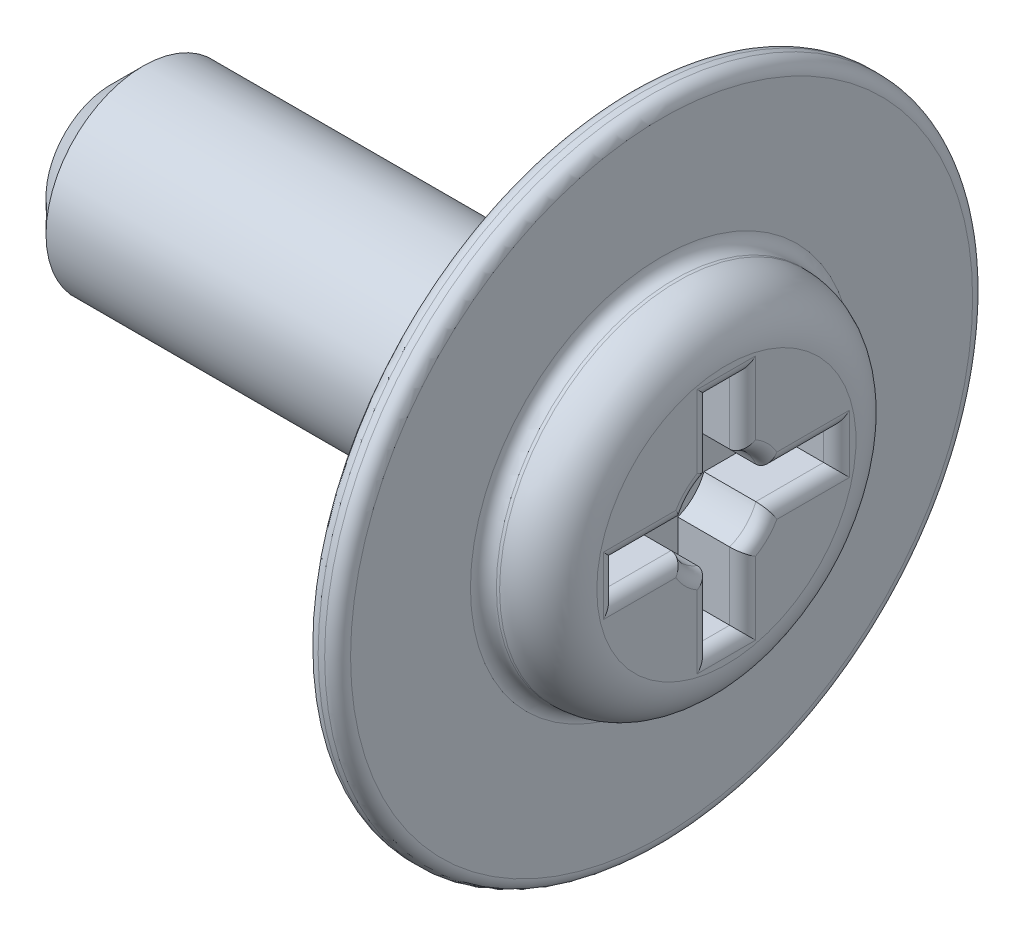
ISO-10303-21;
HEADER;
FILE_DESCRIPTION(('STEP AP214'),'2;1');
FILE_NAME('part.step','',(''),(''),'','','');
FILE_SCHEMA(('AUTOMOTIVE_DESIGN { 1 0 10303 214 1 1 1 1 }'));
ENDSEC;
DATA;
#1=APPLICATION_CONTEXT('core data for automotive mechanical design processes');
#2=APPLICATION_PROTOCOL_DEFINITION('international standard','automotive_design',2000,#1);
#3=PRODUCT_CONTEXT('',#1,'mechanical');
#4=PRODUCT('Part','Part','',(#3));
#5=PRODUCT_RELATED_PRODUCT_CATEGORY('part','',(#4));
#6=PRODUCT_DEFINITION_FORMATION('','',#4);
#7=PRODUCT_DEFINITION_CONTEXT('part definition',#1,'design');
#8=PRODUCT_DEFINITION('design','',#6,#7);
#9=PRODUCT_DEFINITION_SHAPE('','',#8);
#10=(LENGTH_UNIT() NAMED_UNIT(*) SI_UNIT(.MILLI.,.METRE.));
#11=(NAMED_UNIT(*) PLANE_ANGLE_UNIT() SI_UNIT($,.RADIAN.));
#12=(NAMED_UNIT(*) SI_UNIT($,.STERADIAN.) SOLID_ANGLE_UNIT());
#13=UNCERTAINTY_MEASURE_WITH_UNIT(LENGTH_MEASURE(1.E-05),#10,'distance_accuracy_value','');
#14=(GEOMETRIC_REPRESENTATION_CONTEXT(3) GLOBAL_UNCERTAINTY_ASSIGNED_CONTEXT((#13)) GLOBAL_UNIT_ASSIGNED_CONTEXT((#10,
#11,#12)) REPRESENTATION_CONTEXT('',''));
#15=CARTESIAN_POINT('',(0.,0.,0.));
#16=DIRECTION('',(0.,0.,1.));
#17=DIRECTION('',(1.,0.,0.));
#18=AXIS2_PLACEMENT_3D('',#15,#16,#17);
#19=CARTESIAN_POINT('',(0.,0.,0.));
#20=DIRECTION('',(1.,0.,0.));
#21=DIRECTION('',(0.,0.,-1.));
#22=AXIS2_PLACEMENT_3D('',#19,#20,#21);
#23=PLANE('',#22);
#24=CARTESIAN_POINT('',(0.,0.,0.));
#25=DIRECTION('',(1.,0.,0.));
#26=DIRECTION('',(0.,0.,-1.));
#27=AXIS2_PLACEMENT_3D('',#24,#25,#26);
#28=CIRCLE('',#27,1.);
#29=CARTESIAN_POINT('',(0.,0.,-1.));
#30=VERTEX_POINT('',#29);
#31=EDGE_CURVE('E262',#30,#30,#28,.F.);
#32=ORIENTED_EDGE('',*,*,#31,.T.);
#33=EDGE_LOOP('',(#32));
#34=FACE_BOUND('',#33,.T.);
#35=ADVANCED_FACE('F31',(#34),#23,.F.);
#36=CARTESIAN_POINT('',(0.,0.,0.));
#37=DIRECTION('',(-1.,0.,0.));
#38=DIRECTION('',(0.,0.,1.));
#39=AXIS2_PLACEMENT_3D('',#36,#37,#38);
#40=CYLINDRICAL_SURFACE('',#39,1.5);
#41=CARTESIAN_POINT('',(0.500000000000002,0.,0.));
#42=DIRECTION('',(1.,0.,0.));
#43=DIRECTION('',(0.,0.,-1.));
#44=AXIS2_PLACEMENT_3D('',#41,#42,#43);
#45=CIRCLE('',#44,1.5);
#46=CARTESIAN_POINT('',(0.500000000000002,0.,-1.5));
#47=VERTEX_POINT('',#46);
#48=EDGE_CURVE('E265',#47,#47,#45,.T.);
#49=ORIENTED_EDGE('',*,*,#48,.T.);
#50=EDGE_LOOP('',(#49));
#51=FACE_BOUND('',#50,.T.);
#52=CARTESIAN_POINT('',(8.,0.,0.));
#53=DIRECTION('',(-1.,0.,0.));
#54=DIRECTION('',(0.,0.,1.));
#55=AXIS2_PLACEMENT_3D('',#52,#53,#54);
#56=CIRCLE('',#55,1.5);
#57=CARTESIAN_POINT('',(8.,0.,1.5));
#58=VERTEX_POINT('',#57);
#59=EDGE_CURVE('E256',#58,#58,#56,.T.);
#60=ORIENTED_EDGE('',*,*,#59,.T.);
#61=EDGE_LOOP('',(#60));
#62=FACE_BOUND('',#61,.T.);
#63=ADVANCED_FACE('F365',(#51,#62),#40,.T.);
#64=CARTESIAN_POINT('',(8.,1.5,0.));
#65=DIRECTION('',(1.,0.,0.));
#66=DIRECTION('',(0.,0.,-1.));
#67=AXIS2_PLACEMENT_3D('',#64,#65,#66);
#68=PLANE('',#67);
#69=CARTESIAN_POINT('',(8.,0.,0.));
#70=DIRECTION('',(1.,0.,0.));
#71=DIRECTION('',(0.,0.,-1.));
#72=AXIS2_PLACEMENT_3D('',#69,#70,#71);
#73=CIRCLE('',#72,4.8);
#74=CARTESIAN_POINT('',(8.,0.,-4.8));
#75=VERTEX_POINT('',#74);
#76=EDGE_CURVE('E38',#75,#75,#73,.F.);
#77=ORIENTED_EDGE('',*,*,#76,.T.);
#78=EDGE_LOOP('',(#77));
#79=FACE_BOUND('',#78,.T.);
#80=ORIENTED_EDGE('',*,*,#59,.F.);
#81=EDGE_LOOP('',(#80));
#82=FACE_BOUND('',#81,.T.);
#83=ADVANCED_FACE('F345',(#79,#82),#68,.F.);
#84=CARTESIAN_POINT('',(0.,0.,0.));
#85=DIRECTION('',(-1.,0.,0.));
#86=DIRECTION('',(0.,0.,1.));
#87=AXIS2_PLACEMENT_3D('',#84,#85,#86);
#88=CYLINDRICAL_SURFACE('',#87,5.);
#89=CARTESIAN_POINT('',(8.3,0.,0.));
#90=DIRECTION('',(-1.,0.,0.));
#91=DIRECTION('',(0.,0.,1.));
#92=AXIS2_PLACEMENT_3D('',#89,#90,#91);
#93=CIRCLE('',#92,5.);
#94=CARTESIAN_POINT('',(8.3,0.,5.));
#95=VERTEX_POINT('',#94);
#96=EDGE_CURVE('E334',#95,#95,#93,.T.);
#97=ORIENTED_EDGE('',*,*,#96,.T.);
#98=EDGE_LOOP('',(#97));
#99=FACE_BOUND('',#98,.T.);
#100=CARTESIAN_POINT('',(8.2,0.,0.));
#101=DIRECTION('',(1.,0.,0.));
#102=DIRECTION('',(0.,0.,-1.));
#103=AXIS2_PLACEMENT_3D('',#100,#101,#102);
#104=CIRCLE('',#103,5.);
#105=CARTESIAN_POINT('',(8.2,0.,-5.));
#106=VERTEX_POINT('',#105);
#107=EDGE_CURVE('E331',#106,#106,#104,.T.);
#108=ORIENTED_EDGE('',*,*,#107,.T.);
#109=EDGE_LOOP('',(#108));
#110=FACE_BOUND('',#109,.T.);
#111=ADVANCED_FACE('F451',(#99,#110),#88,.T.);
#112=CARTESIAN_POINT('',(8.5,5.,0.));
#113=DIRECTION('',(-1.,0.,0.));
#114=DIRECTION('',(0.,0.,1.));
#115=AXIS2_PLACEMENT_3D('',#112,#113,#114);
#116=PLANE('',#115);
#117=CARTESIAN_POINT('',(8.5,0.,0.));
#118=DIRECTION('',(-1.,0.,0.));
#119=DIRECTION('',(0.,0.,1.));
#120=AXIS2_PLACEMENT_3D('',#117,#118,#119);
#121=CIRCLE('',#120,4.8);
#122=CARTESIAN_POINT('',(8.5,0.,4.8));
#123=VERTEX_POINT('',#122);
#124=EDGE_CURVE('E340',#123,#123,#121,.F.);
#125=ORIENTED_EDGE('',*,*,#124,.T.);
#126=EDGE_LOOP('',(#125));
#127=FACE_BOUND('',#126,.T.);
#128=CARTESIAN_POINT('',(8.5,0.,0.));
#129=DIRECTION('',(-1.,0.,0.));
#130=DIRECTION('',(0.,0.,1.));
#131=AXIS2_PLACEMENT_3D('',#128,#129,#130);
#132=CIRCLE('',#131,2.95);
#133=CARTESIAN_POINT('',(8.5,0.,2.95));
#134=VERTEX_POINT('',#133);
#135=EDGE_CURVE('E337',#134,#134,#132,.T.);
#136=ORIENTED_EDGE('',*,*,#135,.T.);
#137=EDGE_LOOP('',(#136));
#138=FACE_BOUND('',#137,.T.);
#139=ADVANCED_FACE('F447',(#127,#138),#116,.F.);
#140=CARTESIAN_POINT('',(0.,0.,0.));
#141=DIRECTION('',(-1.,0.,0.));
#142=DIRECTION('',(0.,0.,1.));
#143=AXIS2_PLACEMENT_3D('',#140,#141,#142);
#144=CYLINDRICAL_SURFACE('',#143,2.75);
#145=CARTESIAN_POINT('',(8.7,0.,0.));
#146=DIRECTION('',(-1.,0.,0.));
#147=DIRECTION('',(0.,0.,1.));
#148=AXIS2_PLACEMENT_3D('',#145,#146,#147);
#149=CIRCLE('',#148,2.75);
#150=CARTESIAN_POINT('',(8.7,0.,2.75));
#151=VERTEX_POINT('',#150);
#152=EDGE_CURVE('E11',#151,#151,#149,.F.);
#153=ORIENTED_EDGE('',*,*,#152,.T.);
#154=EDGE_LOOP('',(#153));
#155=FACE_BOUND('',#154,.T.);
#156=CARTESIAN_POINT('',(8.75,0.,0.));
#157=DIRECTION('',(-1.,0.,0.));
#158=DIRECTION('',(0.,0.,1.));
#159=AXIS2_PLACEMENT_3D('',#156,#157,#158);
#160=CIRCLE('',#159,2.75);
#161=CARTESIAN_POINT('',(8.75,0.,2.75));
#162=VERTEX_POINT('',#161);
#163=EDGE_CURVE('E253',#162,#162,#160,.T.);
#164=ORIENTED_EDGE('',*,*,#163,.T.);
#165=EDGE_LOOP('',(#164));
#166=FACE_BOUND('',#165,.T.);
#167=ADVANCED_FACE('F443',(#155,#166),#144,.T.);
#168=CARTESIAN_POINT('',(8.75,0.,0.));
#169=DIRECTION('',(-1.,0.,0.));
#170=DIRECTION('',(0.,0.,1.));
#171=AXIS2_PLACEMENT_3D('',#168,#169,#170);
#172=TOROIDAL_SURFACE('',#171,2.,0.750000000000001);
#173=ORIENTED_EDGE('',*,*,#163,.F.);
#174=EDGE_LOOP('',(#173));
#175=FACE_BOUND('',#174,.T.);
#176=CARTESIAN_POINT('',(9.5,0.,0.));
#177=DIRECTION('',(-1.,0.,0.));
#178=DIRECTION('',(0.,0.,1.));
#179=AXIS2_PLACEMENT_3D('',#176,#177,#178);
#180=CIRCLE('',#179,2.);
#181=CARTESIAN_POINT('',(9.5,0.,2.));
#182=VERTEX_POINT('',#181);
#183=EDGE_CURVE('E248',#182,#182,#180,.T.);
#184=ORIENTED_EDGE('',*,*,#183,.T.);
#185=EDGE_LOOP('',(#184));
#186=FACE_BOUND('',#185,.T.);
#187=ADVANCED_FACE('F439',(#175,#186),#172,.T.);
#188=CARTESIAN_POINT('',(9.5,2.,0.));
#189=DIRECTION('',(-1.,0.,0.));
#190=DIRECTION('',(0.,0.,1.));
#191=AXIS2_PLACEMENT_3D('',#188,#189,#190);
#192=PLANE('',#191);
#193=DIRECTION('',(0.,0.,-1.));
#194=VECTOR('',#193,1.);
#195=CARTESIAN_POINT('',(9.5,-0.45,0.));
#196=LINE('',#195,#194);
#197=CARTESIAN_POINT('',(9.5,-0.450000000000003,0.779159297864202));
#198=VERTEX_POINT('',#197);
#199=CARTESIAN_POINT('',(9.5,-0.450000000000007,1.9));
#200=VERTEX_POINT('',#199);
#201=EDGE_CURVE('E299',#198,#200,#196,.F.);
#202=ORIENTED_EDGE('',*,*,#201,.T.);
#203=DIRECTION('',(0.,-1.,0.));
#204=VECTOR('',#203,1.);
#205=CARTESIAN_POINT('',(9.5,1.99999999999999,1.90000000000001));
#206=LINE('',#205,#204);
#207=CARTESIAN_POINT('',(9.5,0.449999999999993,1.9));
#208=VERTEX_POINT('',#207);
#209=EDGE_CURVE('E301',#200,#208,#206,.F.);
#210=ORIENTED_EDGE('',*,*,#209,.T.);
#211=DIRECTION('',(0.,0.,1.));
#212=VECTOR('',#211,1.);
#213=CARTESIAN_POINT('',(9.5,0.45,0.));
#214=LINE('',#213,#212);
#215=CARTESIAN_POINT('',(9.5,0.449999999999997,0.779159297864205));
#216=VERTEX_POINT('',#215);
#217=EDGE_CURVE('E271',#208,#216,#214,.F.);
#218=ORIENTED_EDGE('',*,*,#217,.T.);
#219=CARTESIAN_POINT('',(9.5,0.,0.));
#220=DIRECTION('',(-1.,0.,0.));
#221=DIRECTION('',(0.,0.,1.));
#222=AXIS2_PLACEMENT_3D('',#219,#220,#221);
#223=CIRCLE('',#222,0.89977175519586);
#224=CARTESIAN_POINT('',(9.5,0.779159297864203,0.45));
#225=VERTEX_POINT('',#224);
#226=EDGE_CURVE('E273',#216,#225,#223,.T.);
#227=ORIENTED_EDGE('',*,*,#226,.T.);
#228=DIRECTION('',(0.,-1.,0.));
#229=VECTOR('',#228,1.);
#230=CARTESIAN_POINT('',(9.5,2.,0.45));
#231=LINE('',#230,#229);
#232=CARTESIAN_POINT('',(9.5,1.9,0.45));
#233=VERTEX_POINT('',#232);
#234=EDGE_CURVE('E275',#225,#233,#231,.F.);
#235=ORIENTED_EDGE('',*,*,#234,.T.);
#236=DIRECTION('',(0.,0.,1.));
#237=VECTOR('',#236,1.);
#238=CARTESIAN_POINT('',(9.5,1.9,0.));
#239=LINE('',#238,#237);
#240=CARTESIAN_POINT('',(9.5,1.9,-0.45));
#241=VERTEX_POINT('',#240);
#242=EDGE_CURVE('E277',#233,#241,#239,.F.);
#243=ORIENTED_EDGE('',*,*,#242,.T.);
#244=DIRECTION('',(0.,1.,0.));
#245=VECTOR('',#244,1.);
#246=CARTESIAN_POINT('',(9.5,2.,-0.45));
#247=LINE('',#246,#245);
#248=CARTESIAN_POINT('',(9.5,0.779159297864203,-0.45));
#249=VERTEX_POINT('',#248);
#250=EDGE_CURVE('E279',#241,#249,#247,.F.);
#251=ORIENTED_EDGE('',*,*,#250,.T.);
#252=CARTESIAN_POINT('',(9.5,0.,0.));
#253=DIRECTION('',(-1.,0.,0.));
#254=DIRECTION('',(0.,0.,1.));
#255=AXIS2_PLACEMENT_3D('',#252,#253,#254);
#256=CIRCLE('',#255,0.89977175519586);
#257=CARTESIAN_POINT('',(9.5,0.450000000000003,-0.779159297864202));
#258=VERTEX_POINT('',#257);
#259=EDGE_CURVE('E281',#249,#258,#256,.T.);
#260=ORIENTED_EDGE('',*,*,#259,.T.);
#261=DIRECTION('',(0.,0.,1.));
#262=VECTOR('',#261,1.);
#263=CARTESIAN_POINT('',(9.5,0.45,0.));
#264=LINE('',#263,#262);
#265=CARTESIAN_POINT('',(9.5,0.450000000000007,-1.9));
#266=VERTEX_POINT('',#265);
#267=EDGE_CURVE('E283',#258,#266,#264,.F.);
#268=ORIENTED_EDGE('',*,*,#267,.T.);
#269=DIRECTION('',(0.,1.,0.));
#270=VECTOR('',#269,1.);
#271=CARTESIAN_POINT('',(9.5,2.00000000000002,-1.89999999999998));
#272=LINE('',#271,#270);
#273=CARTESIAN_POINT('',(9.5,-0.44999999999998,-1.9));
#274=VERTEX_POINT('',#273);
#275=EDGE_CURVE('E285',#266,#274,#272,.F.);
#276=ORIENTED_EDGE('',*,*,#275,.T.);
#277=DIRECTION('',(0.,0.,-1.));
#278=VECTOR('',#277,1.);
#279=CARTESIAN_POINT('',(9.5,-0.45,0.));
#280=LINE('',#279,#278);
#281=CARTESIAN_POINT('',(9.5,-0.449999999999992,-0.779159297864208));
#282=VERTEX_POINT('',#281);
#283=EDGE_CURVE('E287',#274,#282,#280,.F.);
#284=ORIENTED_EDGE('',*,*,#283,.T.);
#285=CARTESIAN_POINT('',(9.5,0.,0.));
#286=DIRECTION('',(-1.,0.,0.));
#287=DIRECTION('',(0.,0.,1.));
#288=AXIS2_PLACEMENT_3D('',#285,#286,#287);
#289=CIRCLE('',#288,0.89977175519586);
#290=CARTESIAN_POINT('',(9.5,-0.7791592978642,-0.450000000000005));
#291=VERTEX_POINT('',#290);
#292=EDGE_CURVE('E289',#282,#291,#289,.T.);
#293=ORIENTED_EDGE('',*,*,#292,.T.);
#294=DIRECTION('',(0.,1.,0.));
#295=VECTOR('',#294,1.);
#296=CARTESIAN_POINT('',(9.5,2.,-0.449999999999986));
#297=LINE('',#296,#295);
#298=CARTESIAN_POINT('',(9.5,-1.9,-0.450000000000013));
#299=VERTEX_POINT('',#298);
#300=EDGE_CURVE('E291',#291,#299,#297,.F.);
#301=ORIENTED_EDGE('',*,*,#300,.T.);
#302=DIRECTION('',(0.,0.,-1.));
#303=VECTOR('',#302,1.);
#304=CARTESIAN_POINT('',(9.5,-1.9,0.));
#305=LINE('',#304,#303);
#306=CARTESIAN_POINT('',(9.5,-1.9,0.449999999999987));
#307=VERTEX_POINT('',#306);
#308=EDGE_CURVE('E293',#299,#307,#305,.F.);
#309=ORIENTED_EDGE('',*,*,#308,.T.);
#310=DIRECTION('',(0.,-1.,0.));
#311=VECTOR('',#310,1.);
#312=CARTESIAN_POINT('',(9.5,2.,0.450000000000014));
#313=LINE('',#312,#311);
#314=CARTESIAN_POINT('',(9.5,-0.779159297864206,0.449999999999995));
#315=VERTEX_POINT('',#314);
#316=EDGE_CURVE('E295',#307,#315,#313,.F.);
#317=ORIENTED_EDGE('',*,*,#316,.T.);
#318=CARTESIAN_POINT('',(9.5,0.,0.));
#319=DIRECTION('',(-1.,0.,0.));
#320=DIRECTION('',(0.,0.,1.));
#321=AXIS2_PLACEMENT_3D('',#318,#319,#320);
#322=CIRCLE('',#321,0.89977175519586);
#323=EDGE_CURVE('E297',#315,#198,#322,.T.);
#324=ORIENTED_EDGE('',*,*,#323,.T.);
#325=EDGE_LOOP('',(#202,#210,#218,#227,#235,#243,#251,#260,#268,#276,#284,#293,#301,#309,#317,#324));
#326=FACE_BOUND('',#325,.T.);
#327=ORIENTED_EDGE('',*,*,#183,.F.);
#328=EDGE_LOOP('',(#327));
#329=FACE_BOUND('',#328,.T.);
#330=ADVANCED_FACE('F436',(#326,#329),#192,.F.);
#331=CARTESIAN_POINT('',(8.5,0.,0.25));
#332=DIRECTION('',(0.,0.,1.));
#333=DIRECTION('',(1.,0.,0.));
#334=AXIS2_PLACEMENT_3D('',#331,#332,#333);
#335=PLANE('',#334);
#336=DIRECTION('',(1.,0.,0.));
#337=VECTOR('',#336,1.);
#338=CARTESIAN_POINT('',(8.5,1.7,0.25));
#339=LINE('',#338,#337);
#340=CARTESIAN_POINT('',(8.5,1.7,0.25));
#341=VERTEX_POINT('',#340);
#342=CARTESIAN_POINT('',(9.3,1.7,0.25));
#343=VERTEX_POINT('',#342);
#344=EDGE_CURVE('E246',#341,#343,#339,.T.);
#345=ORIENTED_EDGE('',*,*,#344,.T.);
#346=DIRECTION('',(0.,-1.,0.));
#347=VECTOR('',#346,1.);
#348=CARTESIAN_POINT('',(9.3,0.,0.25));
#349=LINE('',#348,#347);
#350=CARTESIAN_POINT('',(9.3,0.653590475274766,0.25));
#351=VERTEX_POINT('',#350);
#352=EDGE_CURVE('E53',#343,#351,#349,.T.);
#353=ORIENTED_EDGE('',*,*,#352,.T.);
#354=DIRECTION('',(1.,0.,0.));
#355=VECTOR('',#354,1.);
#356=CARTESIAN_POINT('',(6.52074658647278,0.653590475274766,0.25));
#357=LINE('',#356,#355);
#358=CARTESIAN_POINT('',(8.5,0.653590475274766,0.25));
#359=VERTEX_POINT('',#358);
#360=EDGE_CURVE('E805',#351,#359,#357,.F.);
#361=ORIENTED_EDGE('',*,*,#360,.T.);
#362=DIRECTION('',(0.,-1.,0.));
#363=VECTOR('',#362,1.);
#364=CARTESIAN_POINT('',(8.5,0.,0.25));
#365=LINE('',#364,#363);
#366=EDGE_CURVE('E235',#341,#359,#365,.T.);
#367=ORIENTED_EDGE('',*,*,#366,.F.);
#368=EDGE_LOOP('',(#345,#353,#361,#367));
#369=FACE_BOUND('',#368,.T.);
#370=ADVANCED_FACE('F429',(#369),#335,.F.);
#371=CARTESIAN_POINT('',(8.5,1.7,0.25));
#372=DIRECTION('',(0.,1.,0.));
#373=DIRECTION('',(0.,0.,1.));
#374=AXIS2_PLACEMENT_3D('',#371,#372,#373);
#375=PLANE('',#374);
#376=DIRECTION('',(1.,0.,0.));
#377=VECTOR('',#376,1.);
#378=CARTESIAN_POINT('',(8.5,1.7,-0.25));
#379=LINE('',#378,#377);
#380=CARTESIAN_POINT('',(8.5,1.7,-0.25));
#381=VERTEX_POINT('',#380);
#382=CARTESIAN_POINT('',(9.3,1.7,-0.25));
#383=VERTEX_POINT('',#382);
#384=EDGE_CURVE('E245',#381,#383,#379,.T.);
#385=ORIENTED_EDGE('',*,*,#384,.T.);
#386=DIRECTION('',(0.,0.,1.));
#387=VECTOR('',#386,1.);
#388=CARTESIAN_POINT('',(9.3,1.7,0.25));
#389=LINE('',#388,#387);
#390=EDGE_CURVE('E325',#383,#343,#389,.T.);
#391=ORIENTED_EDGE('',*,*,#390,.T.);
#392=ORIENTED_EDGE('',*,*,#344,.F.);
#393=DIRECTION('',(0.,0.,1.));
#394=VECTOR('',#393,1.);
#395=CARTESIAN_POINT('',(8.5,1.7,0.25));
#396=LINE('',#395,#394);
#397=EDGE_CURVE('E242',#381,#341,#396,.T.);
#398=ORIENTED_EDGE('',*,*,#397,.F.);
#399=EDGE_LOOP('',(#385,#391,#392,#398));
#400=FACE_BOUND('',#399,.T.);
#401=ADVANCED_FACE('F426',(#400),#375,.F.);
#402=CARTESIAN_POINT('',(8.5,0.,-0.25));
#403=DIRECTION('',(0.,0.,-1.));
#404=DIRECTION('',(-1.,0.,0.));
#405=AXIS2_PLACEMENT_3D('',#402,#403,#404);
#406=PLANE('',#405);
#407=DIRECTION('',(1.,0.,0.));
#408=VECTOR('',#407,1.);
#409=CARTESIAN_POINT('',(6.52074658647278,0.653590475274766,-0.25));
#410=LINE('',#409,#408);
#411=CARTESIAN_POINT('',(8.5,0.653590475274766,-0.25));
#412=VERTEX_POINT('',#411);
#413=CARTESIAN_POINT('',(9.3,0.653590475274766,-0.25));
#414=VERTEX_POINT('',#413);
#415=EDGE_CURVE('E802',#412,#414,#410,.T.);
#416=ORIENTED_EDGE('',*,*,#415,.T.);
#417=DIRECTION('',(0.,1.,0.));
#418=VECTOR('',#417,1.);
#419=CARTESIAN_POINT('',(9.3,0.,-0.25));
#420=LINE('',#419,#418);
#421=EDGE_CURVE('E323',#414,#383,#420,.T.);
#422=ORIENTED_EDGE('',*,*,#421,.T.);
#423=ORIENTED_EDGE('',*,*,#384,.F.);
#424=DIRECTION('',(0.,1.,0.));
#425=VECTOR('',#424,1.);
#426=CARTESIAN_POINT('',(8.5,0.,-0.25));
#427=LINE('',#426,#425);
#428=EDGE_CURVE('E240',#412,#381,#427,.T.);
#429=ORIENTED_EDGE('',*,*,#428,.F.);
#430=EDGE_LOOP('',(#416,#422,#423,#429));
#431=FACE_BOUND('',#430,.T.);
#432=ADVANCED_FACE('F425',(#431),#406,.F.);
#433=CARTESIAN_POINT('',(8.5,1.7,0.25));
#434=DIRECTION('',(-1.,0.,0.));
#435=DIRECTION('',(0.,0.,1.));
#436=AXIS2_PLACEMENT_3D('',#433,#434,#435);
#437=PLANE('',#436);
#438=CARTESIAN_POINT('',(8.5,0.,0.));
#439=DIRECTION('',(-1.,0.,0.));
#440=DIRECTION('',(0.,0.,1.));
#441=AXIS2_PLACEMENT_3D('',#438,#439,#440);
#442=CIRCLE('',#441,0.69977175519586);
#443=CARTESIAN_POINT('',(8.5,0.250000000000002,-0.653590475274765));
#444=VERTEX_POINT('',#443);
#445=EDGE_CURVE('E897',#444,#412,#442,.F.);
#446=ORIENTED_EDGE('',*,*,#445,.T.);
#447=ORIENTED_EDGE('',*,*,#428,.T.);
#448=ORIENTED_EDGE('',*,*,#397,.T.);
#449=ORIENTED_EDGE('',*,*,#366,.T.);
#450=CARTESIAN_POINT('',(8.5,0.249999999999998,0.653590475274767));
#451=VERTEX_POINT('',#450);
#452=EDGE_CURVE('E215',#359,#451,#442,.F.);
#453=ORIENTED_EDGE('',*,*,#452,.T.);
#454=DIRECTION('',(0.,0.,1.));
#455=VECTOR('',#454,1.);
#456=CARTESIAN_POINT('',(8.5,0.25,0.));
#457=LINE('',#456,#455);
#458=CARTESIAN_POINT('',(8.5,0.249999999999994,1.7));
#459=VERTEX_POINT('',#458);
#460=EDGE_CURVE('E220',#451,#459,#457,.T.);
#461=ORIENTED_EDGE('',*,*,#460,.T.);
#462=DIRECTION('',(0.,-1.,0.));
#463=VECTOR('',#462,1.);
#464=CARTESIAN_POINT('',(8.5,-0.250000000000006,1.7));
#465=LINE('',#464,#463);
#466=CARTESIAN_POINT('',(8.5,-0.250000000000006,1.7));
#467=VERTEX_POINT('',#466);
#468=EDGE_CURVE('E219',#459,#467,#465,.T.);
#469=ORIENTED_EDGE('',*,*,#468,.T.);
#470=DIRECTION('',(0.,0.,-1.));
#471=VECTOR('',#470,1.);
#472=CARTESIAN_POINT('',(8.5,-0.25,0.));
#473=LINE('',#472,#471);
#474=CARTESIAN_POINT('',(8.5,-0.250000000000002,0.653590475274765));
#475=VERTEX_POINT('',#474);
#476=EDGE_CURVE('E197',#467,#475,#473,.T.);
#477=ORIENTED_EDGE('',*,*,#476,.T.);
#478=CARTESIAN_POINT('',(8.5,-0.653590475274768,0.249999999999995));
#479=VERTEX_POINT('',#478);
#480=EDGE_CURVE('E207',#475,#479,#442,.F.);
#481=ORIENTED_EDGE('',*,*,#480,.T.);
#482=DIRECTION('',(0.,-1.,0.));
#483=VECTOR('',#482,1.);
#484=CARTESIAN_POINT('',(8.5,0.,0.25));
#485=LINE('',#484,#483);
#486=CARTESIAN_POINT('',(8.5,-1.7,0.249999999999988));
#487=VERTEX_POINT('',#486);
#488=EDGE_CURVE('E821',#479,#487,#485,.T.);
#489=ORIENTED_EDGE('',*,*,#488,.T.);
#490=DIRECTION('',(0.,0.,-1.));
#491=VECTOR('',#490,1.);
#492=CARTESIAN_POINT('',(8.5,-1.7,-0.250000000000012));
#493=LINE('',#492,#491);
#494=CARTESIAN_POINT('',(8.5,-1.7,-0.250000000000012));
#495=VERTEX_POINT('',#494);
#496=EDGE_CURVE('E823',#487,#495,#493,.T.);
#497=ORIENTED_EDGE('',*,*,#496,.T.);
#498=DIRECTION('',(0.,1.,0.));
#499=VECTOR('',#498,1.);
#500=CARTESIAN_POINT('',(8.5,0.,-0.25));
#501=LINE('',#500,#499);
#502=CARTESIAN_POINT('',(8.5,-0.653590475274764,-0.250000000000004));
#503=VERTEX_POINT('',#502);
#504=EDGE_CURVE('E816',#495,#503,#501,.T.);
#505=ORIENTED_EDGE('',*,*,#504,.T.);
#506=CARTESIAN_POINT('',(8.5,-0.249999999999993,-0.653590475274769));
#507=VERTEX_POINT('',#506);
#508=EDGE_CURVE('E213',#503,#507,#442,.F.);
#509=ORIENTED_EDGE('',*,*,#508,.T.);
#510=DIRECTION('',(0.,0.,-1.));
#511=VECTOR('',#510,1.);
#512=CARTESIAN_POINT('',(8.5,-0.25,0.));
#513=LINE('',#512,#511);
#514=CARTESIAN_POINT('',(8.5,-0.249999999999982,-1.7));
#515=VERTEX_POINT('',#514);
#516=EDGE_CURVE('E807',#507,#515,#513,.T.);
#517=ORIENTED_EDGE('',*,*,#516,.T.);
#518=DIRECTION('',(0.,1.,0.));
#519=VECTOR('',#518,1.);
#520=CARTESIAN_POINT('',(8.5,0.250000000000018,-1.7));
#521=LINE('',#520,#519);
#522=CARTESIAN_POINT('',(8.5,0.250000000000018,-1.7));
#523=VERTEX_POINT('',#522);
#524=EDGE_CURVE('E809',#515,#523,#521,.T.);
#525=ORIENTED_EDGE('',*,*,#524,.T.);
#526=EDGE_CURVE('E223',#523,#444,#457,.T.);
#527=ORIENTED_EDGE('',*,*,#526,.T.);
#528=EDGE_LOOP('',(#446,#447,#448,#449,#453,#461,#469,#477,#481,#489,#497,#505,#509,#517,#525,#527));
#529=FACE_BOUND('',#528,.T.);
#530=ADVANCED_FACE('F217',(#529),#437,.F.);
#531=CARTESIAN_POINT('',(8.5,0.25,0.));
#532=DIRECTION('',(0.,1.,0.));
#533=DIRECTION('',(0.,0.,1.));
#534=AXIS2_PLACEMENT_3D('',#531,#532,#533);
#535=PLANE('',#534);
#536=DIRECTION('',(1.,0.,0.));
#537=VECTOR('',#536,1.);
#538=CARTESIAN_POINT('',(6.52074658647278,0.249999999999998,0.653590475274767));
#539=LINE('',#538,#537);
#540=CARTESIAN_POINT('',(9.3,0.249999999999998,0.653590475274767));
#541=VERTEX_POINT('',#540);
#542=EDGE_CURVE('E800',#451,#541,#539,.T.);
#543=ORIENTED_EDGE('',*,*,#542,.T.);
#544=DIRECTION('',(0.,0.,1.));
#545=VECTOR('',#544,1.);
#546=CARTESIAN_POINT('',(9.3,0.25,0.));
#547=LINE('',#546,#545);
#548=CARTESIAN_POINT('',(9.3,0.249999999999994,1.7));
#549=VERTEX_POINT('',#548);
#550=EDGE_CURVE('E329',#541,#549,#547,.T.);
#551=ORIENTED_EDGE('',*,*,#550,.T.);
#552=DIRECTION('',(1.,0.,0.));
#553=VECTOR('',#552,1.);
#554=CARTESIAN_POINT('',(8.5,0.249999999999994,1.7));
#555=LINE('',#554,#553);
#556=EDGE_CURVE('E232',#459,#549,#555,.T.);
#557=ORIENTED_EDGE('',*,*,#556,.F.);
#558=ORIENTED_EDGE('',*,*,#460,.F.);
#559=EDGE_LOOP('',(#543,#551,#557,#558));
#560=FACE_BOUND('',#559,.T.);
#561=ADVANCED_FACE('F416',(#560),#535,.F.);
#562=DIRECTION('',(1.,0.,0.));
#563=VECTOR('',#562,1.);
#564=CARTESIAN_POINT('',(8.5,0.250000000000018,-1.7));
#565=LINE('',#564,#563);
#566=CARTESIAN_POINT('',(9.3,0.250000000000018,-1.7));
#567=VERTEX_POINT('',#566);
#568=EDGE_CURVE('E813',#523,#567,#565,.T.);
#569=ORIENTED_EDGE('',*,*,#568,.T.);
#570=DIRECTION('',(0.,0.,1.));
#571=VECTOR('',#570,1.);
#572=CARTESIAN_POINT('',(9.3,0.25,0.));
#573=LINE('',#572,#571);
#574=CARTESIAN_POINT('',(9.3,0.250000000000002,-0.653590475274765));
#575=VERTEX_POINT('',#574);
#576=EDGE_CURVE('E319',#567,#575,#573,.T.);
#577=ORIENTED_EDGE('',*,*,#576,.T.);
#578=DIRECTION('',(1.,0.,0.));
#579=VECTOR('',#578,1.);
#580=CARTESIAN_POINT('',(6.52074658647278,0.250000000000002,-0.653590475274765));
#581=LINE('',#580,#579);
#582=EDGE_CURVE('E203',#575,#444,#581,.F.);
#583=ORIENTED_EDGE('',*,*,#582,.T.);
#584=ORIENTED_EDGE('',*,*,#526,.F.);
#585=EDGE_LOOP('',(#569,#577,#583,#584));
#586=FACE_BOUND('',#585,.T.);
#587=ADVANCED_FACE('F419',(#586),#535,.F.);
#588=CARTESIAN_POINT('',(8.5,-0.25,0.));
#589=DIRECTION('',(0.,-1.,0.));
#590=DIRECTION('',(0.,0.,-1.));
#591=AXIS2_PLACEMENT_3D('',#588,#589,#590);
#592=PLANE('',#591);
#593=DIRECTION('',(1.,0.,0.));
#594=VECTOR('',#593,1.);
#595=CARTESIAN_POINT('',(8.5,-0.250000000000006,1.7));
#596=LINE('',#595,#594);
#597=CARTESIAN_POINT('',(9.3,-0.250000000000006,1.7));
#598=VERTEX_POINT('',#597);
#599=EDGE_CURVE('E233',#467,#598,#596,.T.);
#600=ORIENTED_EDGE('',*,*,#599,.T.);
#601=DIRECTION('',(0.,0.,-1.));
#602=VECTOR('',#601,1.);
#603=CARTESIAN_POINT('',(9.3,-0.25,0.));
#604=LINE('',#603,#602);
#605=CARTESIAN_POINT('',(9.3,-0.250000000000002,0.653590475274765));
#606=VERTEX_POINT('',#605);
#607=EDGE_CURVE('E200',#598,#606,#604,.T.);
#608=ORIENTED_EDGE('',*,*,#607,.T.);
#609=DIRECTION('',(1.,0.,0.));
#610=VECTOR('',#609,1.);
#611=CARTESIAN_POINT('',(6.52074658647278,-0.250000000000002,0.653590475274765));
#612=LINE('',#611,#610);
#613=EDGE_CURVE('E192',#606,#475,#612,.F.);
#614=ORIENTED_EDGE('',*,*,#613,.T.);
#615=ORIENTED_EDGE('',*,*,#476,.F.);
#616=EDGE_LOOP('',(#600,#608,#614,#615));
#617=FACE_BOUND('',#616,.T.);
#618=ADVANCED_FACE('F195',(#617),#592,.F.);
#619=CARTESIAN_POINT('',(8.5,-0.250000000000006,1.7));
#620=DIRECTION('',(0.,0.,1.));
#621=DIRECTION('',(0.,-1.,0.));
#622=AXIS2_PLACEMENT_3D('',#619,#620,#621);
#623=PLANE('',#622);
#624=ORIENTED_EDGE('',*,*,#556,.T.);
#625=DIRECTION('',(0.,-1.,0.));
#626=VECTOR('',#625,1.);
#627=CARTESIAN_POINT('',(9.3,-0.250000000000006,1.7));
#628=LINE('',#627,#626);
#629=EDGE_CURVE('E268',#549,#598,#628,.T.);
#630=ORIENTED_EDGE('',*,*,#629,.T.);
#631=ORIENTED_EDGE('',*,*,#599,.F.);
#632=ORIENTED_EDGE('',*,*,#468,.F.);
#633=EDGE_LOOP('',(#624,#630,#631,#632));
#634=FACE_BOUND('',#633,.T.);
#635=ADVANCED_FACE('F411',(#634),#623,.F.);
#636=CARTESIAN_POINT('',(8.5,0.,-0.25));
#637=DIRECTION('',(0.,0.,-1.));
#638=DIRECTION('',(0.,1.,0.));
#639=AXIS2_PLACEMENT_3D('',#636,#637,#638);
#640=PLANE('',#639);
#641=DIRECTION('',(1.,0.,0.));
#642=VECTOR('',#641,1.);
#643=CARTESIAN_POINT('',(8.5,-1.7,-0.250000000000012));
#644=LINE('',#643,#642);
#645=CARTESIAN_POINT('',(9.3,-1.7,-0.250000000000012));
#646=VERTEX_POINT('',#645);
#647=EDGE_CURVE('E221',#495,#646,#644,.T.);
#648=ORIENTED_EDGE('',*,*,#647,.T.);
#649=DIRECTION('',(0.,1.,0.));
#650=VECTOR('',#649,1.);
#651=CARTESIAN_POINT('',(9.3,0.,-0.25));
#652=LINE('',#651,#650);
#653=CARTESIAN_POINT('',(9.3,-0.653590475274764,-0.250000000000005));
#654=VERTEX_POINT('',#653);
#655=EDGE_CURVE('E311',#646,#654,#652,.T.);
#656=ORIENTED_EDGE('',*,*,#655,.T.);
#657=DIRECTION('',(1.,0.,0.));
#658=VECTOR('',#657,1.);
#659=CARTESIAN_POINT('',(6.52074658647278,-0.653590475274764,-0.250000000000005));
#660=LINE('',#659,#658);
#661=EDGE_CURVE('E204',#654,#503,#660,.F.);
#662=ORIENTED_EDGE('',*,*,#661,.T.);
#663=ORIENTED_EDGE('',*,*,#504,.F.);
#664=EDGE_LOOP('',(#648,#656,#662,#663));
#665=FACE_BOUND('',#664,.T.);
#666=ADVANCED_FACE('F404',(#665),#640,.F.);
#667=CARTESIAN_POINT('',(8.5,-1.7,-0.250000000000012));
#668=DIRECTION('',(0.,-1.,0.));
#669=DIRECTION('',(0.,0.,-1.));
#670=AXIS2_PLACEMENT_3D('',#667,#668,#669);
#671=PLANE('',#670);
#672=DIRECTION('',(1.,0.,0.));
#673=VECTOR('',#672,1.);
#674=CARTESIAN_POINT('',(8.5,-1.7,0.249999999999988));
#675=LINE('',#674,#673);
#676=CARTESIAN_POINT('',(9.3,-1.7,0.249999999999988));
#677=VERTEX_POINT('',#676);
#678=EDGE_CURVE('E226',#487,#677,#675,.T.);
#679=ORIENTED_EDGE('',*,*,#678,.T.);
#680=DIRECTION('',(0.,0.,-1.));
#681=VECTOR('',#680,1.);
#682=CARTESIAN_POINT('',(9.3,-1.7,-0.250000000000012));
#683=LINE('',#682,#681);
#684=EDGE_CURVE('E309',#677,#646,#683,.T.);
#685=ORIENTED_EDGE('',*,*,#684,.T.);
#686=ORIENTED_EDGE('',*,*,#647,.F.);
#687=ORIENTED_EDGE('',*,*,#496,.F.);
#688=EDGE_LOOP('',(#679,#685,#686,#687));
#689=FACE_BOUND('',#688,.T.);
#690=ADVANCED_FACE('F401',(#689),#671,.F.);
#691=CARTESIAN_POINT('',(8.5,0.,0.25));
#692=DIRECTION('',(0.,0.,1.));
#693=DIRECTION('',(0.,-1.,0.));
#694=AXIS2_PLACEMENT_3D('',#691,#692,#693);
#695=PLANE('',#694);
#696=DIRECTION('',(1.,0.,0.));
#697=VECTOR('',#696,1.);
#698=CARTESIAN_POINT('',(6.52074658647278,-0.653590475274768,0.249999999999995));
#699=LINE('',#698,#697);
#700=CARTESIAN_POINT('',(9.3,-0.653590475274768,0.249999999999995));
#701=VERTEX_POINT('',#700);
#702=EDGE_CURVE('E210',#479,#701,#699,.T.);
#703=ORIENTED_EDGE('',*,*,#702,.T.);
#704=DIRECTION('',(0.,-1.,0.));
#705=VECTOR('',#704,1.);
#706=CARTESIAN_POINT('',(9.3,0.,0.25));
#707=LINE('',#706,#705);
#708=EDGE_CURVE('E307',#701,#677,#707,.T.);
#709=ORIENTED_EDGE('',*,*,#708,.T.);
#710=ORIENTED_EDGE('',*,*,#678,.F.);
#711=ORIENTED_EDGE('',*,*,#488,.F.);
#712=EDGE_LOOP('',(#703,#709,#710,#711));
#713=FACE_BOUND('',#712,.T.);
#714=ADVANCED_FACE('F396',(#713),#695,.F.);
#715=CARTESIAN_POINT('',(8.5,0.250000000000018,-1.7));
#716=DIRECTION('',(0.,0.,-1.));
#717=DIRECTION('',(0.,1.,0.));
#718=AXIS2_PLACEMENT_3D('',#715,#716,#717);
#719=PLANE('',#718);
#720=DIRECTION('',(1.,0.,0.));
#721=VECTOR('',#720,1.);
#722=CARTESIAN_POINT('',(8.5,-0.249999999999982,-1.7));
#723=LINE('',#722,#721);
#724=CARTESIAN_POINT('',(9.3,-0.249999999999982,-1.7));
#725=VERTEX_POINT('',#724);
#726=EDGE_CURVE('E812',#515,#725,#723,.T.);
#727=ORIENTED_EDGE('',*,*,#726,.T.);
#728=DIRECTION('',(0.,1.,0.));
#729=VECTOR('',#728,1.);
#730=CARTESIAN_POINT('',(9.3,0.250000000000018,-1.7));
#731=LINE('',#730,#729);
#732=EDGE_CURVE('E317',#725,#567,#731,.T.);
#733=ORIENTED_EDGE('',*,*,#732,.T.);
#734=ORIENTED_EDGE('',*,*,#568,.F.);
#735=ORIENTED_EDGE('',*,*,#524,.F.);
#736=EDGE_LOOP('',(#727,#733,#734,#735));
#737=FACE_BOUND('',#736,.T.);
#738=ADVANCED_FACE('F392',(#737),#719,.F.);
#739=CARTESIAN_POINT('',(8.5,-0.25,0.));
#740=DIRECTION('',(0.,-1.,0.));
#741=DIRECTION('',(0.,0.,-1.));
#742=AXIS2_PLACEMENT_3D('',#739,#740,#741);
#743=PLANE('',#742);
#744=DIRECTION('',(1.,0.,0.));
#745=VECTOR('',#744,1.);
#746=CARTESIAN_POINT('',(6.52074658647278,-0.249999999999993,-0.653590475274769));
#747=LINE('',#746,#745);
#748=CARTESIAN_POINT('',(9.3,-0.249999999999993,-0.653590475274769));
#749=VERTEX_POINT('',#748);
#750=EDGE_CURVE('E259',#507,#749,#747,.T.);
#751=ORIENTED_EDGE('',*,*,#750,.T.);
#752=DIRECTION('',(0.,0.,-1.));
#753=VECTOR('',#752,1.);
#754=CARTESIAN_POINT('',(9.3,-0.25,0.));
#755=LINE('',#754,#753);
#756=EDGE_CURVE('E315',#749,#725,#755,.T.);
#757=ORIENTED_EDGE('',*,*,#756,.T.);
#758=ORIENTED_EDGE('',*,*,#726,.F.);
#759=ORIENTED_EDGE('',*,*,#516,.F.);
#760=EDGE_LOOP('',(#751,#757,#758,#759));
#761=FACE_BOUND('',#760,.T.);
#762=ADVANCED_FACE('F395',(#761),#743,.F.);
#763=CARTESIAN_POINT('',(6.52074658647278,0.,0.));
#764=DIRECTION('',(1.,0.,0.));
#765=DIRECTION('',(0.,0.,-1.));
#766=AXIS2_PLACEMENT_3D('',#763,#764,#765);
#767=CYLINDRICAL_SURFACE('',#766,0.69977175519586);
#768=ORIENTED_EDGE('',*,*,#661,.F.);
#769=CARTESIAN_POINT('',(9.3,0.,0.));
#770=DIRECTION('',(-1.,0.,0.));
#771=DIRECTION('',(0.,0.,1.));
#772=AXIS2_PLACEMENT_3D('',#769,#770,#771);
#773=CIRCLE('',#772,0.69977175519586);
#774=EDGE_CURVE('E313',#654,#749,#773,.F.);
#775=ORIENTED_EDGE('',*,*,#774,.T.);
#776=ORIENTED_EDGE('',*,*,#750,.F.);
#777=ORIENTED_EDGE('',*,*,#508,.F.);
#778=EDGE_LOOP('',(#768,#775,#776,#777));
#779=FACE_BOUND('',#778,.T.);
#780=ADVANCED_FACE('F388',(#779),#767,.F.);
#781=ORIENTED_EDGE('',*,*,#613,.F.);
#782=CARTESIAN_POINT('',(9.3,0.,0.));
#783=DIRECTION('',(-1.,0.,0.));
#784=DIRECTION('',(0.,0.,1.));
#785=AXIS2_PLACEMENT_3D('',#782,#783,#784);
#786=CIRCLE('',#785,0.69977175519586);
#787=EDGE_CURVE('E305',#606,#701,#786,.F.);
#788=ORIENTED_EDGE('',*,*,#787,.T.);
#789=ORIENTED_EDGE('',*,*,#702,.F.);
#790=ORIENTED_EDGE('',*,*,#480,.F.);
#791=EDGE_LOOP('',(#781,#788,#789,#790));
#792=FACE_BOUND('',#791,.T.);
#793=ADVANCED_FACE('F208',(#792),#767,.F.);
#794=ORIENTED_EDGE('',*,*,#582,.F.);
#795=CARTESIAN_POINT('',(9.3,0.,0.));
#796=DIRECTION('',(-1.,0.,0.));
#797=DIRECTION('',(0.,0.,1.));
#798=AXIS2_PLACEMENT_3D('',#795,#796,#797);
#799=CIRCLE('',#798,0.69977175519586);
#800=EDGE_CURVE('E321',#575,#414,#799,.F.);
#801=ORIENTED_EDGE('',*,*,#800,.T.);
#802=ORIENTED_EDGE('',*,*,#415,.F.);
#803=ORIENTED_EDGE('',*,*,#445,.F.);
#804=EDGE_LOOP('',(#794,#801,#802,#803));
#805=FACE_BOUND('',#804,.T.);
#806=ADVANCED_FACE('F386',(#805),#767,.F.);
#807=ORIENTED_EDGE('',*,*,#360,.F.);
#808=CARTESIAN_POINT('',(9.3,0.,0.));
#809=DIRECTION('',(-1.,0.,0.));
#810=DIRECTION('',(0.,0.,1.));
#811=AXIS2_PLACEMENT_3D('',#808,#809,#810);
#812=CIRCLE('',#811,0.69977175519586);
#813=EDGE_CURVE('E45',#351,#541,#812,.F.);
#814=ORIENTED_EDGE('',*,*,#813,.T.);
#815=ORIENTED_EDGE('',*,*,#542,.F.);
#816=ORIENTED_EDGE('',*,*,#452,.F.);
#817=EDGE_LOOP('',(#807,#814,#815,#816));
#818=FACE_BOUND('',#817,.T.);
#819=ADVANCED_FACE('F376',(#818),#767,.F.);
#820=CARTESIAN_POINT('',(0.,0.,0.));
#821=DIRECTION('',(1.,0.,0.));
#822=DIRECTION('',(0.,0.,-1.));
#823=AXIS2_PLACEMENT_3D('',#820,#821,#822);
#824=CONICAL_SURFACE('',#823,1.,0.785398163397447);
#825=ORIENTED_EDGE('',*,*,#48,.F.);
#826=EDGE_LOOP('',(#825));
#827=FACE_BOUND('',#826,.T.);
#828=ORIENTED_EDGE('',*,*,#31,.F.);
#829=EDGE_LOOP('',(#828));
#830=FACE_BOUND('',#829,.T.);
#831=ADVANCED_FACE('F373',(#827,#830),#824,.T.);
#832=CARTESIAN_POINT('',(9.3,0.25000000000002,-1.9));
#833=DIRECTION('',(0.,1.,0.));
#834=DIRECTION('',(0.,0.,1.));
#835=AXIS2_PLACEMENT_3D('',#832,#833,#834);
#836=CYLINDRICAL_SURFACE('',#835,0.2);
#837=CARTESIAN_POINT('',(9.3,-0.44999999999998,-1.9));
#838=DIRECTION('',(0.,0.707106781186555,-0.70710678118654));
#839=DIRECTION('',(0.,-0.70710678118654,-0.707106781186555));
#840=AXIS2_PLACEMENT_3D('',#837,#838,#839);
#841=ELLIPSE('',#840,0.282842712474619,0.2);
#842=EDGE_CURVE('E791',#274,#725,#841,.F.);
#843=ORIENTED_EDGE('',*,*,#842,.F.);
#844=ORIENTED_EDGE('',*,*,#275,.F.);
#845=CARTESIAN_POINT('',(9.3,0.450000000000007,-1.9));
#846=DIRECTION('',(0.,0.707106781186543,0.707106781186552));
#847=DIRECTION('',(0.,0.707106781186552,-0.707106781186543));
#848=AXIS2_PLACEMENT_3D('',#845,#846,#847);
#849=ELLIPSE('',#848,0.282842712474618,0.2);
#850=EDGE_CURVE('E794',#567,#266,#849,.T.);
#851=ORIENTED_EDGE('',*,*,#850,.F.);
#852=ORIENTED_EDGE('',*,*,#732,.F.);
#853=EDGE_LOOP('',(#843,#844,#851,#852));
#854=FACE_BOUND('',#853,.T.);
#855=ADVANCED_FACE('F375',(#854),#836,.T.);
#856=CARTESIAN_POINT('',(9.3,0.45,0.));
#857=DIRECTION('',(0.,0.,1.));
#858=DIRECTION('',(0.,-1.,0.));
#859=AXIS2_PLACEMENT_3D('',#856,#857,#858);
#860=CYLINDRICAL_SURFACE('',#859,0.2);
#861=ORIENTED_EDGE('',*,*,#850,.T.);
#862=ORIENTED_EDGE('',*,*,#267,.F.);
#863=CARTESIAN_POINT('',(9.3,0.250000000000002,-0.653590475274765));
#864=CARTESIAN_POINT('',(9.30991208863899,0.249986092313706,-0.653578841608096));
#865=CARTESIAN_POINT('',(9.31980808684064,0.250735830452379,-0.654096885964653));
#866=CARTESIAN_POINT('',(9.33923450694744,0.253645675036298,-0.656095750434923));
#867=CARTESIAN_POINT('',(9.34876670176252,0.255797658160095,-0.657571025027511));
#868=CARTESIAN_POINT('',(9.36723785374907,0.261393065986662,-0.661386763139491));
#869=CARTESIAN_POINT('',(9.37617771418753,0.264834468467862,-0.663725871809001));
#870=CARTESIAN_POINT('',(9.39330621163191,0.272846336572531,-0.66913311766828));
#871=CARTESIAN_POINT('',(9.40149385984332,0.277418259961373,-0.672202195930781));
#872=CARTESIAN_POINT('',(9.41754102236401,0.287881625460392,-0.679168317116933));
#873=CARTESIAN_POINT('',(9.42533493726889,0.293844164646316,-0.683108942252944));
#874=CARTESIAN_POINT('',(9.43982161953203,0.306669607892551,-0.691501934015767));
#875=CARTESIAN_POINT('',(9.44651415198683,0.313532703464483,-0.695954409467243));
#876=CARTESIAN_POINT('',(9.45977718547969,0.329196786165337,-0.706010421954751));
#877=CARTESIAN_POINT('',(9.46614013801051,0.338129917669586,-0.711681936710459));
#878=CARTESIAN_POINT('',(9.47726573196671,0.356754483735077,-0.72335675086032));
#879=CARTESIAN_POINT('',(9.48202642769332,0.366446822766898,-0.729360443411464));
#880=CARTESIAN_POINT('',(9.49045542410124,0.387746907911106,-0.742386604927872));
#881=CARTESIAN_POINT('',(9.4938820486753,0.399434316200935,-0.749435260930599));
#882=CARTESIAN_POINT('',(9.49856348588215,0.423193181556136,-0.763560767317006));
#883=CARTESIAN_POINT('',(9.49982325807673,0.435263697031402,-0.770637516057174));
#884=CARTESIAN_POINT('',(9.4999942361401,0.448245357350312,-0.778145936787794));
#885=CARTESIAN_POINT('',(9.50000001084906,0.44912262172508,-0.778652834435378));
#886=CARTESIAN_POINT('',(9.5,0.450000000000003,-0.779159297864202));
#887=B_SPLINE_CURVE_WITH_KNOTS('',3,(#863,#864,#865,#866,#867,#868,#869,#870,#871,#872,#873,
#874,#875,#876,#877,#878,#879,#880,#881,#882,#883,#884,#885,#886),.UNSPECIFIED.,.F.,.F.,(4,2,2,
2,2,2,2,2,2,2,2,4),(0.,0.0296690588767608,0.0591677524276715,0.0886203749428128,
0.11811117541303,0.149716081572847,0.181327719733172,0.218225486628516,0.255167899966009,
0.297212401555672,0.339160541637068,0.342200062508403),.UNSPECIFIED.);
#888=EDGE_CURVE('E776',#575,#258,#887,.T.);
#889=ORIENTED_EDGE('',*,*,#888,.F.);
#890=ORIENTED_EDGE('',*,*,#576,.F.);
#891=EDGE_LOOP('',(#861,#862,#889,#890));
#892=FACE_BOUND('',#891,.T.);
#893=ADVANCED_FACE('F383',(#892),#860,.T.);
#894=CARTESIAN_POINT('',(9.3,-0.45,0.));
#895=DIRECTION('',(0.,0.,-1.));
#896=DIRECTION('',(0.,1.,0.));
#897=AXIS2_PLACEMENT_3D('',#894,#895,#896);
#898=CYLINDRICAL_SURFACE('',#897,0.2);
#899=ORIENTED_EDGE('',*,*,#842,.T.);
#900=ORIENTED_EDGE('',*,*,#756,.F.);
#901=CARTESIAN_POINT('',(9.3,-0.249999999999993,-0.653590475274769));
#902=CARTESIAN_POINT('',(9.30991208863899,-0.249986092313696,-0.653578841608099));
#903=CARTESIAN_POINT('',(9.31980808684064,-0.25073583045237,-0.654096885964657));
#904=CARTESIAN_POINT('',(9.33923450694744,-0.253645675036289,-0.656095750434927));
#905=CARTESIAN_POINT('',(9.34876670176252,-0.255797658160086,-0.657571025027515));
#906=CARTESIAN_POINT('',(9.36723785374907,-0.261393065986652,-0.661386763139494));
#907=CARTESIAN_POINT('',(9.37617771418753,-0.264834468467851,-0.663725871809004));
#908=CARTESIAN_POINT('',(9.39330621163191,-0.272846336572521,-0.669133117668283));
#909=CARTESIAN_POINT('',(9.40149385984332,-0.277418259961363,-0.672202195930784));
#910=CARTESIAN_POINT('',(9.41754102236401,-0.287881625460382,-0.679168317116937));
#911=CARTESIAN_POINT('',(9.42533493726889,-0.293844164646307,-0.683108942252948));
#912=CARTESIAN_POINT('',(9.43982161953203,-0.306669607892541,-0.691501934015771));
#913=CARTESIAN_POINT('',(9.44651415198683,-0.313532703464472,-0.695954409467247));
#914=CARTESIAN_POINT('',(9.45977718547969,-0.329196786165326,-0.706010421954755));
#915=CARTESIAN_POINT('',(9.46614013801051,-0.338129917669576,-0.711681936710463));
#916=CARTESIAN_POINT('',(9.47726573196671,-0.356754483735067,-0.723356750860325));
#917=CARTESIAN_POINT('',(9.48202642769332,-0.366446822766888,-0.729360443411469));
#918=CARTESIAN_POINT('',(9.49045542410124,-0.387746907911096,-0.742386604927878));
#919=CARTESIAN_POINT('',(9.4938820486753,-0.399434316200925,-0.749435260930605));
#920=CARTESIAN_POINT('',(9.49856348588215,-0.423193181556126,-0.763560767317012));
#921=CARTESIAN_POINT('',(9.49982325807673,-0.435263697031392,-0.77063751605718));
#922=CARTESIAN_POINT('',(9.4999942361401,-0.448245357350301,-0.7781459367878));
#923=CARTESIAN_POINT('',(9.50000001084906,-0.449122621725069,-0.778652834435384));
#924=CARTESIAN_POINT('',(9.5,-0.449999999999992,-0.779159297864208));
#925=B_SPLINE_CURVE_WITH_KNOTS('',3,(#901,#902,#903,#904,#905,#906,#907,#908,#909,#910,#911,
#912,#913,#914,#915,#916,#917,#918,#919,#920,#921,#922,#923,#924),.UNSPECIFIED.,.F.,.F.,(4,2,2,
2,2,2,2,2,2,2,2,4),(0.,0.0296690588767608,0.0591677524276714,0.0886203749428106,
0.11811117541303,0.149716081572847,0.181327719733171,0.218225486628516,0.25516789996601,
0.297212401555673,0.339160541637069,0.342200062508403),.UNSPECIFIED.);
#926=EDGE_CURVE('E770',#282,#749,#925,.F.);
#927=ORIENTED_EDGE('',*,*,#926,.F.);
#928=ORIENTED_EDGE('',*,*,#283,.F.);
#929=EDGE_LOOP('',(#899,#900,#927,#928));
#930=FACE_BOUND('',#929,.T.);
#931=ADVANCED_FACE('F572',(#930),#898,.T.);
#932=CARTESIAN_POINT('',(9.3,0.,0.));
#933=DIRECTION('',(-1.,0.,0.));
#934=DIRECTION('',(0.,0.,1.));
#935=AXIS2_PLACEMENT_3D('',#932,#933,#934);
#936=TOROIDAL_SURFACE('',#935,0.89977175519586,0.2);
#937=ORIENTED_EDGE('',*,*,#888,.T.);
#938=ORIENTED_EDGE('',*,*,#259,.F.);
#939=CARTESIAN_POINT('',(9.3,0.653590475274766,-0.25));
#940=CARTESIAN_POINT('',(9.30991208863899,0.653578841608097,-0.249986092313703));
#941=CARTESIAN_POINT('',(9.31980808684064,0.654096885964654,-0.250735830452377));
#942=CARTESIAN_POINT('',(9.33923450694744,0.656095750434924,-0.253645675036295));
#943=CARTESIAN_POINT('',(9.34876670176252,0.657571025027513,-0.255797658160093));
#944=CARTESIAN_POINT('',(9.36723785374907,0.661386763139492,-0.261393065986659));
#945=CARTESIAN_POINT('',(9.37617771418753,0.663725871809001,-0.264834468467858));
#946=CARTESIAN_POINT('',(9.39330621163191,0.66913311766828,-0.272846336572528));
#947=CARTESIAN_POINT('',(9.40149385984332,0.672202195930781,-0.27741825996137));
#948=CARTESIAN_POINT('',(9.41754102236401,0.679168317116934,-0.287881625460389));
#949=CARTESIAN_POINT('',(9.42533493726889,0.683108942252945,-0.293844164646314));
#950=CARTESIAN_POINT('',(9.43982161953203,0.691501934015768,-0.306669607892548));
#951=CARTESIAN_POINT('',(9.44651415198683,0.695954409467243,-0.313532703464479));
#952=CARTESIAN_POINT('',(9.45977718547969,0.706010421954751,-0.329196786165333));
#953=CARTESIAN_POINT('',(9.46614013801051,0.71168193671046,-0.338129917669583));
#954=CARTESIAN_POINT('',(9.47726573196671,0.723356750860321,-0.356754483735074));
#955=CARTESIAN_POINT('',(9.48202642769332,0.729360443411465,-0.366446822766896));
#956=CARTESIAN_POINT('',(9.49045542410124,0.742386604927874,-0.387746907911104));
#957=CARTESIAN_POINT('',(9.4938820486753,0.749435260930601,-0.399434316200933));
#958=CARTESIAN_POINT('',(9.49856348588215,0.763560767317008,-0.423193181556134));
#959=CARTESIAN_POINT('',(9.49982325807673,0.770637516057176,-0.435263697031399));
#960=CARTESIAN_POINT('',(9.4999942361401,0.778145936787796,-0.448245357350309));
#961=CARTESIAN_POINT('',(9.50000001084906,0.778652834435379,-0.449122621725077));
#962=CARTESIAN_POINT('',(9.5,0.779159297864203,-0.45));
#963=B_SPLINE_CURVE_WITH_KNOTS('',3,(#939,#940,#941,#942,#943,#944,#945,#946,#947,#948,#949,
#950,#951,#952,#953,#954,#955,#956,#957,#958,#959,#960,#961,#962),.UNSPECIFIED.,.F.,.F.,(4,2,2,
2,2,2,2,2,2,2,2,4),(0.,0.0296690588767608,0.0591677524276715,0.0886203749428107,
0.11811117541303,0.149716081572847,0.181327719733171,0.218225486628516,0.25516789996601,
0.297212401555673,0.339160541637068,0.342200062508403),.UNSPECIFIED.);
#964=EDGE_CURVE('E777',#414,#249,#963,.T.);
#965=ORIENTED_EDGE('',*,*,#964,.F.);
#966=ORIENTED_EDGE('',*,*,#800,.F.);
#967=EDGE_LOOP('',(#937,#938,#965,#966));
#968=FACE_BOUND('',#967,.T.);
#969=ADVANCED_FACE('F581',(#968),#936,.T.);
#970=CARTESIAN_POINT('',(9.3,0.,0.));
#971=DIRECTION('',(-1.,0.,0.));
#972=DIRECTION('',(0.,0.,1.));
#973=AXIS2_PLACEMENT_3D('',#970,#971,#972);
#974=TOROIDAL_SURFACE('',#973,0.89977175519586,0.2);
#975=ORIENTED_EDGE('',*,*,#926,.T.);
#976=ORIENTED_EDGE('',*,*,#774,.F.);
#977=CARTESIAN_POINT('',(9.3,-0.653590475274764,-0.250000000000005));
#978=CARTESIAN_POINT('',(9.30991208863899,-0.653578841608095,-0.249986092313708));
#979=CARTESIAN_POINT('',(9.31980808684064,-0.654096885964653,-0.250735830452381));
#980=CARTESIAN_POINT('',(9.33923450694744,-0.656095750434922,-0.2536456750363));
#981=CARTESIAN_POINT('',(9.34876670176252,-0.657571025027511,-0.255797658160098));
#982=CARTESIAN_POINT('',(9.36723785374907,-0.66138676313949,-0.261393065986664));
#983=CARTESIAN_POINT('',(9.37617771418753,-0.663725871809,-0.264834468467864));
#984=CARTESIAN_POINT('',(9.39330621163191,-0.669133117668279,-0.272846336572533));
#985=CARTESIAN_POINT('',(9.40149385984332,-0.67220219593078,-0.277418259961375));
#986=CARTESIAN_POINT('',(9.41754102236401,-0.679168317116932,-0.287881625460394));
#987=CARTESIAN_POINT('',(9.42533493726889,-0.683108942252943,-0.293844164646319));
#988=CARTESIAN_POINT('',(9.43982161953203,-0.691501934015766,-0.306669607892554));
#989=CARTESIAN_POINT('',(9.44651415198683,-0.695954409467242,-0.313532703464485));
#990=CARTESIAN_POINT('',(9.45977718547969,-0.706010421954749,-0.329196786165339));
#991=CARTESIAN_POINT('',(9.46614013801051,-0.711681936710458,-0.338129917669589));
#992=CARTESIAN_POINT('',(9.47726573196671,-0.723356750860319,-0.356754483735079));
#993=CARTESIAN_POINT('',(9.48202642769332,-0.729360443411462,-0.366446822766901));
#994=CARTESIAN_POINT('',(9.49045542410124,-0.742386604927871,-0.387746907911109));
#995=CARTESIAN_POINT('',(9.4938820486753,-0.749435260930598,-0.399434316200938));
#996=CARTESIAN_POINT('',(9.49856348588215,-0.763560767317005,-0.423193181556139));
#997=CARTESIAN_POINT('',(9.49982325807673,-0.770637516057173,-0.435263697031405));
#998=CARTESIAN_POINT('',(9.4999942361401,-0.778145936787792,-0.448245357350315));
#999=CARTESIAN_POINT('',(9.50000001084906,-0.778652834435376,-0.449122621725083));
#1000=CARTESIAN_POINT('',(9.5,-0.7791592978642,-0.450000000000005));
#1001=B_SPLINE_CURVE_WITH_KNOTS('',3,(#977,#978,#979,#980,#981,#982,#983,#984,#985,#986,#987,
#988,#989,#990,#991,#992,#993,#994,#995,#996,#997,#998,#999,#1000),.UNSPECIFIED.,.F.,.F.,(4,2,2,
2,2,2,2,2,2,2,2,4),(0.,0.0296690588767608,0.0591677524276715,0.0886203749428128,
0.11811117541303,0.149716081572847,0.181327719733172,0.218225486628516,0.255167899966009,
0.297212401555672,0.339160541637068,0.342200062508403),.UNSPECIFIED.);
#1002=EDGE_CURVE('E763',#291,#654,#1001,.F.);
#1003=ORIENTED_EDGE('',*,*,#1002,.F.);
#1004=ORIENTED_EDGE('',*,*,#292,.F.);
#1005=EDGE_LOOP('',(#975,#976,#1003,#1004));
#1006=FACE_BOUND('',#1005,.T.);
#1007=ADVANCED_FACE('F591',(#1006),#974,.T.);
#1008=CARTESIAN_POINT('',(9.3,0.,-0.45));
#1009=DIRECTION('',(0.,1.,0.));
#1010=DIRECTION('',(0.,0.,1.));
#1011=AXIS2_PLACEMENT_3D('',#1008,#1009,#1010);
#1012=CYLINDRICAL_SURFACE('',#1011,0.2);
#1013=ORIENTED_EDGE('',*,*,#964,.T.);
#1014=ORIENTED_EDGE('',*,*,#250,.F.);
#1015=CARTESIAN_POINT('',(9.3,1.9,-0.45));
#1016=DIRECTION('',(0.,0.707106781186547,0.707106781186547));
#1017=DIRECTION('',(0.,0.707106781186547,-0.707106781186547));
#1018=AXIS2_PLACEMENT_3D('',#1015,#1016,#1017);
#1019=ELLIPSE('',#1018,0.282842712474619,0.2);
#1020=EDGE_CURVE('E844',#383,#241,#1019,.T.);
#1021=ORIENTED_EDGE('',*,*,#1020,.F.);
#1022=ORIENTED_EDGE('',*,*,#421,.F.);
#1023=EDGE_LOOP('',(#1013,#1014,#1021,#1022));
#1024=FACE_BOUND('',#1023,.T.);
#1025=ADVANCED_FACE('F601',(#1024),#1012,.T.);
#1026=CARTESIAN_POINT('',(9.3,0.,-0.45));
#1027=DIRECTION('',(0.,1.,0.));
#1028=DIRECTION('',(0.,0.,1.));
#1029=AXIS2_PLACEMENT_3D('',#1026,#1027,#1028);
#1030=CYLINDRICAL_SURFACE('',#1029,0.2);
#1031=ORIENTED_EDGE('',*,*,#1002,.T.);
#1032=ORIENTED_EDGE('',*,*,#655,.F.);
#1033=CARTESIAN_POINT('',(9.3,-1.9,-0.450000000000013));
#1034=DIRECTION('',(0.,0.707106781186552,-0.707106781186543));
#1035=DIRECTION('',(0.,-0.707106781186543,-0.707106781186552));
#1036=AXIS2_PLACEMENT_3D('',#1033,#1034,#1035);
#1037=ELLIPSE('',#1036,0.282842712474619,0.2);
#1038=EDGE_CURVE('E836',#299,#646,#1037,.F.);
#1039=ORIENTED_EDGE('',*,*,#1038,.F.);
#1040=ORIENTED_EDGE('',*,*,#300,.F.);
#1041=EDGE_LOOP('',(#1031,#1032,#1039,#1040));
#1042=FACE_BOUND('',#1041,.T.);
#1043=ADVANCED_FACE('F611',(#1042),#1030,.T.);
#1044=CARTESIAN_POINT('',(9.3,1.9,0.25));
#1045=DIRECTION('',(0.,0.,1.));
#1046=DIRECTION('',(1.,0.,0.));
#1047=AXIS2_PLACEMENT_3D('',#1044,#1045,#1046);
#1048=CYLINDRICAL_SURFACE('',#1047,0.2);
#1049=ORIENTED_EDGE('',*,*,#1020,.T.);
#1050=ORIENTED_EDGE('',*,*,#242,.F.);
#1051=CARTESIAN_POINT('',(9.3,1.9,0.45));
#1052=DIRECTION('',(0.,-0.707106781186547,0.707106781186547));
#1053=DIRECTION('',(0.,0.707106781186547,0.707106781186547));
#1054=AXIS2_PLACEMENT_3D('',#1051,#1052,#1053);
#1055=ELLIPSE('',#1054,0.282842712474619,0.2);
#1056=EDGE_CURVE('E839',#343,#233,#1055,.T.);
#1057=ORIENTED_EDGE('',*,*,#1056,.F.);
#1058=ORIENTED_EDGE('',*,*,#390,.F.);
#1059=EDGE_LOOP('',(#1049,#1050,#1057,#1058));
#1060=FACE_BOUND('',#1059,.T.);
#1061=ADVANCED_FACE('F621',(#1060),#1048,.T.);
#1062=CARTESIAN_POINT('',(9.3,-1.9,-0.250000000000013));
#1063=DIRECTION('',(0.,0.,-1.));
#1064=DIRECTION('',(0.,1.,0.));
#1065=AXIS2_PLACEMENT_3D('',#1062,#1063,#1064);
#1066=CYLINDRICAL_SURFACE('',#1065,0.2);
#1067=ORIENTED_EDGE('',*,*,#1038,.T.);
#1068=ORIENTED_EDGE('',*,*,#684,.F.);
#1069=CARTESIAN_POINT('',(9.3,-1.9,0.449999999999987));
#1070=DIRECTION('',(0.,-0.707106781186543,-0.707106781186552));
#1071=DIRECTION('',(0.,-0.707106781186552,0.707106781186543));
#1072=AXIS2_PLACEMENT_3D('',#1069,#1070,#1071);
#1073=ELLIPSE('',#1072,0.282842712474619,0.2);
#1074=EDGE_CURVE('E833',#307,#677,#1073,.F.);
#1075=ORIENTED_EDGE('',*,*,#1074,.F.);
#1076=ORIENTED_EDGE('',*,*,#308,.F.);
#1077=EDGE_LOOP('',(#1067,#1068,#1075,#1076));
#1078=FACE_BOUND('',#1077,.T.);
#1079=ADVANCED_FACE('F631',(#1078),#1066,.T.);
#1080=CARTESIAN_POINT('',(9.3,0.,0.45));
#1081=DIRECTION('',(0.,-1.,0.));
#1082=DIRECTION('',(0.,0.,-1.));
#1083=AXIS2_PLACEMENT_3D('',#1080,#1081,#1082);
#1084=CYLINDRICAL_SURFACE('',#1083,0.2);
#1085=ORIENTED_EDGE('',*,*,#1056,.T.);
#1086=ORIENTED_EDGE('',*,*,#234,.F.);
#1087=CARTESIAN_POINT('',(9.3,0.653590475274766,0.25));
#1088=CARTESIAN_POINT('',(9.30991208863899,0.653578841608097,0.249986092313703));
#1089=CARTESIAN_POINT('',(9.31980808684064,0.654096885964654,0.250735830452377));
#1090=CARTESIAN_POINT('',(9.33923450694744,0.656095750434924,0.253645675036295));
#1091=CARTESIAN_POINT('',(9.34876670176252,0.657571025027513,0.255797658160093));
#1092=CARTESIAN_POINT('',(9.36723785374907,0.661386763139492,0.261393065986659));
#1093=CARTESIAN_POINT('',(9.37617771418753,0.663725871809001,0.264834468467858));
#1094=CARTESIAN_POINT('',(9.39330621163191,0.66913311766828,0.272846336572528));
#1095=CARTESIAN_POINT('',(9.40149385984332,0.672202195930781,0.27741825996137));
#1096=CARTESIAN_POINT('',(9.41754102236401,0.679168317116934,0.287881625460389));
#1097=CARTESIAN_POINT('',(9.42533493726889,0.683108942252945,0.293844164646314));
#1098=CARTESIAN_POINT('',(9.43982161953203,0.691501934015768,0.306669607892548));
#1099=CARTESIAN_POINT('',(9.44651415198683,0.695954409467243,0.313532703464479));
#1100=CARTESIAN_POINT('',(9.45977718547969,0.706010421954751,0.329196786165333));
#1101=CARTESIAN_POINT('',(9.46614013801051,0.71168193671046,0.338129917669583));
#1102=CARTESIAN_POINT('',(9.47726573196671,0.723356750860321,0.356754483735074));
#1103=CARTESIAN_POINT('',(9.48202642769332,0.729360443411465,0.366446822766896));
#1104=CARTESIAN_POINT('',(9.49045542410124,0.742386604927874,0.387746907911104));
#1105=CARTESIAN_POINT('',(9.4938820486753,0.749435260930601,0.399434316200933));
#1106=CARTESIAN_POINT('',(9.49856348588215,0.763560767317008,0.423193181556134));
#1107=CARTESIAN_POINT('',(9.49982325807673,0.770637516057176,0.435263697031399));
#1108=CARTESIAN_POINT('',(9.4999942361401,0.778145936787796,0.448245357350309));
#1109=CARTESIAN_POINT('',(9.50000001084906,0.778652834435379,0.449122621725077));
#1110=CARTESIAN_POINT('',(9.5,0.779159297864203,0.45));
#1111=B_SPLINE_CURVE_WITH_KNOTS('',3,(#1087,#1088,#1089,#1090,#1091,#1092,#1093,#1094,#1095,
#1096,#1097,#1098,#1099,#1100,#1101,#1102,#1103,#1104,#1105,#1106,#1107,#1108,#1109,#1110),
.UNSPECIFIED.,.F.,.F.,(4,2,2,2,2,2,2,2,2,2,2,4),(0.,0.0296690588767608,0.0591677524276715,
0.0886203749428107,0.11811117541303,0.149716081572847,0.181327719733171,0.218225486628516,
0.25516789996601,0.297212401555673,0.339160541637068,0.342200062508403),.UNSPECIFIED.);
#1112=EDGE_CURVE('E747',#351,#225,#1111,.T.);
#1113=ORIENTED_EDGE('',*,*,#1112,.F.);
#1114=ORIENTED_EDGE('',*,*,#352,.F.);
#1115=EDGE_LOOP('',(#1085,#1086,#1113,#1114));
#1116=FACE_BOUND('',#1115,.T.);
#1117=ADVANCED_FACE('F641',(#1116),#1084,.T.);
#1118=CARTESIAN_POINT('',(9.3,0.,0.45));
#1119=DIRECTION('',(0.,-1.,0.));
#1120=DIRECTION('',(0.,0.,-1.));
#1121=AXIS2_PLACEMENT_3D('',#1118,#1119,#1120);
#1122=CYLINDRICAL_SURFACE('',#1121,0.2);
#1123=ORIENTED_EDGE('',*,*,#1074,.T.);
#1124=ORIENTED_EDGE('',*,*,#708,.F.);
#1125=CARTESIAN_POINT('',(9.3,-0.653590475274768,0.249999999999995));
#1126=CARTESIAN_POINT('',(9.30991208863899,-0.653578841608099,0.249986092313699));
#1127=CARTESIAN_POINT('',(9.31980808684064,-0.654096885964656,0.250735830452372));
#1128=CARTESIAN_POINT('',(9.33923450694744,-0.656095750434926,0.253645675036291));
#1129=CARTESIAN_POINT('',(9.34876670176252,-0.657571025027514,0.255797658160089));
#1130=CARTESIAN_POINT('',(9.36723785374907,-0.661386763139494,0.261393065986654));
#1131=CARTESIAN_POINT('',(9.37617771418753,-0.663725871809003,0.264834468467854));
#1132=CARTESIAN_POINT('',(9.39330621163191,-0.669133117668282,0.272846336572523));
#1133=CARTESIAN_POINT('',(9.40149385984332,-0.672202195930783,0.277418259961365));
#1134=CARTESIAN_POINT('',(9.41754102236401,-0.679168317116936,0.287881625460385));
#1135=CARTESIAN_POINT('',(9.42533493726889,-0.683108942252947,0.293844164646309));
#1136=CARTESIAN_POINT('',(9.43982161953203,-0.69150193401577,0.306669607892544));
#1137=CARTESIAN_POINT('',(9.44651415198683,-0.695954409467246,0.313532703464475));
#1138=CARTESIAN_POINT('',(9.45977718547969,-0.706010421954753,0.329196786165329));
#1139=CARTESIAN_POINT('',(9.46614013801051,-0.711681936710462,0.338129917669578));
#1140=CARTESIAN_POINT('',(9.47726573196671,-0.723356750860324,0.356754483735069));
#1141=CARTESIAN_POINT('',(9.48202642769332,-0.729360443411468,0.366446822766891));
#1142=CARTESIAN_POINT('',(9.49045542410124,-0.742386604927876,0.387746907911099));
#1143=CARTESIAN_POINT('',(9.4938820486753,-0.749435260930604,0.399434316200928));
#1144=CARTESIAN_POINT('',(9.49856348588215,-0.763560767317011,0.423193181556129));
#1145=CARTESIAN_POINT('',(9.49982325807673,-0.770637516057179,0.435263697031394));
#1146=CARTESIAN_POINT('',(9.4999942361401,-0.778145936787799,0.448245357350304));
#1147=CARTESIAN_POINT('',(9.50000001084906,-0.778652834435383,0.449122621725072));
#1148=CARTESIAN_POINT('',(9.5,-0.779159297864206,0.449999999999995));
#1149=B_SPLINE_CURVE_WITH_KNOTS('',3,(#1125,#1126,#1127,#1128,#1129,#1130,#1131,#1132,#1133,
#1134,#1135,#1136,#1137,#1138,#1139,#1140,#1141,#1142,#1143,#1144,#1145,#1146,#1147,#1148),
.UNSPECIFIED.,.F.,.F.,(4,2,2,2,2,2,2,2,2,2,2,4),(0.,0.0296690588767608,0.0591677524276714,
0.0886203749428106,0.11811117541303,0.149716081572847,0.181327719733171,0.218225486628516,
0.25516789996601,0.297212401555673,0.339160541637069,0.342200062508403),.UNSPECIFIED.);
#1150=EDGE_CURVE('E741',#315,#701,#1149,.F.);
#1151=ORIENTED_EDGE('',*,*,#1150,.F.);
#1152=ORIENTED_EDGE('',*,*,#316,.F.);
#1153=EDGE_LOOP('',(#1123,#1124,#1151,#1152));
#1154=FACE_BOUND('',#1153,.T.);
#1155=ADVANCED_FACE('F651',(#1154),#1122,.T.);
#1156=CARTESIAN_POINT('',(9.3,0.,0.));
#1157=DIRECTION('',(-1.,0.,0.));
#1158=DIRECTION('',(0.,0.,1.));
#1159=AXIS2_PLACEMENT_3D('',#1156,#1157,#1158);
#1160=TOROIDAL_SURFACE('',#1159,0.89977175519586,0.2);
#1161=ORIENTED_EDGE('',*,*,#1112,.T.);
#1162=ORIENTED_EDGE('',*,*,#226,.F.);
#1163=CARTESIAN_POINT('',(9.3,0.249999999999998,0.653590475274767));
#1164=CARTESIAN_POINT('',(9.30991208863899,0.249986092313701,0.653578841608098));
#1165=CARTESIAN_POINT('',(9.31980808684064,0.250735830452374,0.654096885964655));
#1166=CARTESIAN_POINT('',(9.33923450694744,0.253645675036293,0.656095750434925));
#1167=CARTESIAN_POINT('',(9.34876670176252,0.255797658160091,0.657571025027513));
#1168=CARTESIAN_POINT('',(9.36723785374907,0.261393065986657,0.661386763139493));
#1169=CARTESIAN_POINT('',(9.37617771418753,0.264834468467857,0.663725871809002));
#1170=CARTESIAN_POINT('',(9.39330621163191,0.272846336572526,0.669133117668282));
#1171=CARTESIAN_POINT('',(9.40149385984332,0.277418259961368,0.672202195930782));
#1172=CARTESIAN_POINT('',(9.41754102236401,0.287881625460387,0.679168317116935));
#1173=CARTESIAN_POINT('',(9.42533493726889,0.293844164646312,0.683108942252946));
#1174=CARTESIAN_POINT('',(9.43982161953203,0.306669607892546,0.691501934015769));
#1175=CARTESIAN_POINT('',(9.44651415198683,0.313532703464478,0.695954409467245));
#1176=CARTESIAN_POINT('',(9.45977718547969,0.329196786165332,0.706010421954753));
#1177=CARTESIAN_POINT('',(9.46614013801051,0.338129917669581,0.711681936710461));
#1178=CARTESIAN_POINT('',(9.47726573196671,0.356754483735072,0.723356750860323));
#1179=CARTESIAN_POINT('',(9.48202642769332,0.366446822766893,0.729360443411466));
#1180=CARTESIAN_POINT('',(9.49045542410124,0.387746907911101,0.742386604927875));
#1181=CARTESIAN_POINT('',(9.4938820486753,0.39943431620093,0.749435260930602));
#1182=CARTESIAN_POINT('',(9.49856348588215,0.423193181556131,0.763560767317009));
#1183=CARTESIAN_POINT('',(9.49982325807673,0.435263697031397,0.770637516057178));
#1184=CARTESIAN_POINT('',(9.4999942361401,0.448245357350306,0.778145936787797));
#1185=CARTESIAN_POINT('',(9.50000001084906,0.449122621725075,0.778652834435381));
#1186=CARTESIAN_POINT('',(9.5,0.449999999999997,0.779159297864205));
#1187=B_SPLINE_CURVE_WITH_KNOTS('',3,(#1163,#1164,#1165,#1166,#1167,#1168,#1169,#1170,#1171,
#1172,#1173,#1174,#1175,#1176,#1177,#1178,#1179,#1180,#1181,#1182,#1183,#1184,#1185,#1186),
.UNSPECIFIED.,.F.,.F.,(4,2,2,2,2,2,2,2,2,2,2,4),(0.,0.0296690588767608,0.0591677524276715,
0.0886203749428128,0.11811117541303,0.149716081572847,0.181327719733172,0.218225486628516,
0.255167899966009,0.297212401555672,0.339160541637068,0.342200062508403),.UNSPECIFIED.);
#1188=EDGE_CURVE('E748',#541,#216,#1187,.T.);
#1189=ORIENTED_EDGE('',*,*,#1188,.F.);
#1190=ORIENTED_EDGE('',*,*,#813,.F.);
#1191=EDGE_LOOP('',(#1161,#1162,#1189,#1190));
#1192=FACE_BOUND('',#1191,.T.);
#1193=ADVANCED_FACE('F661',(#1192),#1160,.T.);
#1194=CARTESIAN_POINT('',(9.3,0.,0.));
#1195=DIRECTION('',(-1.,0.,0.));
#1196=DIRECTION('',(0.,0.,1.));
#1197=AXIS2_PLACEMENT_3D('',#1194,#1195,#1196);
#1198=TOROIDAL_SURFACE('',#1197,0.89977175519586,0.2);
#1199=ORIENTED_EDGE('',*,*,#1150,.T.);
#1200=ORIENTED_EDGE('',*,*,#787,.F.);
#1201=CARTESIAN_POINT('',(9.3,-0.250000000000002,0.653590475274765));
#1202=CARTESIAN_POINT('',(9.30991208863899,-0.249986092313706,0.653578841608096));
#1203=CARTESIAN_POINT('',(9.31980808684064,-0.250735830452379,0.654096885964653));
#1204=CARTESIAN_POINT('',(9.33923450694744,-0.253645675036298,0.656095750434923));
#1205=CARTESIAN_POINT('',(9.34876670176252,-0.255797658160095,0.657571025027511));
#1206=CARTESIAN_POINT('',(9.36723785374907,-0.261393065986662,0.661386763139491));
#1207=CARTESIAN_POINT('',(9.37617771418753,-0.264834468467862,0.663725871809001));
#1208=CARTESIAN_POINT('',(9.39330621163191,-0.272846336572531,0.66913311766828));
#1209=CARTESIAN_POINT('',(9.40149385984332,-0.277418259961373,0.672202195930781));
#1210=CARTESIAN_POINT('',(9.41754102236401,-0.287881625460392,0.679168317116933));
#1211=CARTESIAN_POINT('',(9.42533493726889,-0.293844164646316,0.683108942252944));
#1212=CARTESIAN_POINT('',(9.43982161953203,-0.306669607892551,0.691501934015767));
#1213=CARTESIAN_POINT('',(9.44651415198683,-0.313532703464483,0.695954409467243));
#1214=CARTESIAN_POINT('',(9.45977718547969,-0.329196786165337,0.706010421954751));
#1215=CARTESIAN_POINT('',(9.46614013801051,-0.338129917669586,0.711681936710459));
#1216=CARTESIAN_POINT('',(9.47726573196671,-0.356754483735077,0.72335675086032));
#1217=CARTESIAN_POINT('',(9.48202642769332,-0.366446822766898,0.729360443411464));
#1218=CARTESIAN_POINT('',(9.49045542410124,-0.387746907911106,0.742386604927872));
#1219=CARTESIAN_POINT('',(9.4938820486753,-0.399434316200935,0.749435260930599));
#1220=CARTESIAN_POINT('',(9.49856348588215,-0.423193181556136,0.763560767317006));
#1221=CARTESIAN_POINT('',(9.49982325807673,-0.435263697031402,0.770637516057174));
#1222=CARTESIAN_POINT('',(9.4999942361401,-0.448245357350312,0.778145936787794));
#1223=CARTESIAN_POINT('',(9.50000001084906,-0.44912262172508,0.778652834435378));
#1224=CARTESIAN_POINT('',(9.5,-0.450000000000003,0.779159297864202));
#1225=B_SPLINE_CURVE_WITH_KNOTS('',3,(#1201,#1202,#1203,#1204,#1205,#1206,#1207,#1208,#1209,
#1210,#1211,#1212,#1213,#1214,#1215,#1216,#1217,#1218,#1219,#1220,#1221,#1222,#1223,#1224),
.UNSPECIFIED.,.F.,.F.,(4,2,2,2,2,2,2,2,2,2,2,4),(0.,0.0296690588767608,0.0591677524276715,
0.0886203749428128,0.11811117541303,0.149716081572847,0.181327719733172,0.218225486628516,
0.255167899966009,0.297212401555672,0.339160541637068,0.342200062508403),.UNSPECIFIED.);
#1226=EDGE_CURVE('E734',#198,#606,#1225,.F.);
#1227=ORIENTED_EDGE('',*,*,#1226,.F.);
#1228=ORIENTED_EDGE('',*,*,#323,.F.);
#1229=EDGE_LOOP('',(#1199,#1200,#1227,#1228));
#1230=FACE_BOUND('',#1229,.T.);
#1231=ADVANCED_FACE('F671',(#1230),#1198,.T.);
#1232=CARTESIAN_POINT('',(9.3,0.45,0.));
#1233=DIRECTION('',(0.,0.,1.));
#1234=DIRECTION('',(0.,-1.,0.));
#1235=AXIS2_PLACEMENT_3D('',#1232,#1233,#1234);
#1236=CYLINDRICAL_SURFACE('',#1235,0.2);
#1237=ORIENTED_EDGE('',*,*,#1188,.T.);
#1238=ORIENTED_EDGE('',*,*,#217,.F.);
#1239=CARTESIAN_POINT('',(9.3,0.449999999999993,1.9));
#1240=DIRECTION('',(0.,-0.70710678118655,0.707106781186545));
#1241=DIRECTION('',(0.,-0.707106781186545,-0.70710678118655));
#1242=AXIS2_PLACEMENT_3D('',#1239,#1240,#1241);
#1243=ELLIPSE('',#1242,0.282842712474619,0.2);
#1244=EDGE_CURVE('E876',#549,#208,#1243,.T.);
#1245=ORIENTED_EDGE('',*,*,#1244,.F.);
#1246=ORIENTED_EDGE('',*,*,#550,.F.);
#1247=EDGE_LOOP('',(#1237,#1238,#1245,#1246));
#1248=FACE_BOUND('',#1247,.T.);
#1249=ADVANCED_FACE('F681',(#1248),#1236,.T.);
#1250=CARTESIAN_POINT('',(9.3,-0.45,0.));
#1251=DIRECTION('',(0.,0.,-1.));
#1252=DIRECTION('',(0.,1.,0.));
#1253=AXIS2_PLACEMENT_3D('',#1250,#1251,#1252);
#1254=CYLINDRICAL_SURFACE('',#1253,0.2);
#1255=ORIENTED_EDGE('',*,*,#1226,.T.);
#1256=ORIENTED_EDGE('',*,*,#607,.F.);
#1257=CARTESIAN_POINT('',(9.3,-0.450000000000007,1.9));
#1258=DIRECTION('',(0.,-0.707106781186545,-0.70710678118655));
#1259=DIRECTION('',(0.,-0.70710678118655,0.707106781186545));
#1260=AXIS2_PLACEMENT_3D('',#1257,#1258,#1259);
#1261=ELLIPSE('',#1260,0.282842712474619,0.2);
#1262=EDGE_CURVE('E878',#200,#598,#1261,.F.);
#1263=ORIENTED_EDGE('',*,*,#1262,.F.);
#1264=ORIENTED_EDGE('',*,*,#201,.F.);
#1265=EDGE_LOOP('',(#1255,#1256,#1263,#1264));
#1266=FACE_BOUND('',#1265,.T.);
#1267=ADVANCED_FACE('F691',(#1266),#1254,.T.);
#1268=CARTESIAN_POINT('',(9.3,-0.250000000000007,1.9));
#1269=DIRECTION('',(0.,-1.,0.));
#1270=DIRECTION('',(0.,0.,-1.));
#1271=AXIS2_PLACEMENT_3D('',#1268,#1269,#1270);
#1272=CYLINDRICAL_SURFACE('',#1271,0.2);
#1273=ORIENTED_EDGE('',*,*,#1244,.T.);
#1274=ORIENTED_EDGE('',*,*,#209,.F.);
#1275=ORIENTED_EDGE('',*,*,#1262,.T.);
#1276=ORIENTED_EDGE('',*,*,#629,.F.);
#1277=EDGE_LOOP('',(#1273,#1274,#1275,#1276));
#1278=FACE_BOUND('',#1277,.T.);
#1279=ADVANCED_FACE('F360',(#1278),#1272,.T.);
#1280=CARTESIAN_POINT('',(8.3,0.,0.));
#1281=DIRECTION('',(-1.,0.,0.));
#1282=DIRECTION('',(0.,0.,1.));
#1283=AXIS2_PLACEMENT_3D('',#1280,#1281,#1282);
#1284=TOROIDAL_SURFACE('',#1283,4.8,0.2);
#1285=ORIENTED_EDGE('',*,*,#124,.F.);
#1286=EDGE_LOOP('',(#1285));
#1287=FACE_BOUND('',#1286,.T.);
#1288=ORIENTED_EDGE('',*,*,#96,.F.);
#1289=EDGE_LOOP('',(#1288));
#1290=FACE_BOUND('',#1289,.T.);
#1291=ADVANCED_FACE('F351',(#1287,#1290),#1284,.T.);
#1292=CARTESIAN_POINT('',(8.2,0.,0.));
#1293=DIRECTION('',(1.,0.,0.));
#1294=DIRECTION('',(0.,0.,-1.));
#1295=AXIS2_PLACEMENT_3D('',#1292,#1293,#1294);
#1296=TOROIDAL_SURFACE('',#1295,4.8,0.2);
#1297=ORIENTED_EDGE('',*,*,#107,.F.);
#1298=EDGE_LOOP('',(#1297));
#1299=FACE_BOUND('',#1298,.T.);
#1300=ORIENTED_EDGE('',*,*,#76,.F.);
#1301=EDGE_LOOP('',(#1300));
#1302=FACE_BOUND('',#1301,.T.);
#1303=ADVANCED_FACE('F348',(#1299,#1302),#1296,.T.);
#1304=CARTESIAN_POINT('',(8.7,0.,0.));
#1305=DIRECTION('',(-1.,0.,0.));
#1306=DIRECTION('',(0.,0.,1.));
#1307=AXIS2_PLACEMENT_3D('',#1304,#1305,#1306);
#1308=TOROIDAL_SURFACE('',#1307,2.95,0.2);
#1309=ORIENTED_EDGE('',*,*,#152,.F.);
#1310=EDGE_LOOP('',(#1309));
#1311=FACE_BOUND('',#1310,.T.);
#1312=ORIENTED_EDGE('',*,*,#135,.F.);
#1313=EDGE_LOOP('',(#1312));
#1314=FACE_BOUND('',#1313,.T.);
#1315=ADVANCED_FACE('F350',(#1311,#1314),#1308,.F.);
#1316=CLOSED_SHELL('',(#35,#63,#83,#111,#139,#167,#187,#330,#370,#401,#432,#530,#561,#587,#618,
#635,#666,#690,#714,#738,#762,#780,#793,#806,#819,#831,#855,#893,#931,#969,#1007,#1025,#1043,
#1061,#1079,#1117,#1155,#1193,#1231,#1249,#1267,#1279,#1291,#1303,#1315));
#1317=MANIFOLD_SOLID_BREP('B2',#1316);
#1318=ADVANCED_BREP_SHAPE_REPRESENTATION('',(#18,#1317),#14);
#1319=SHAPE_DEFINITION_REPRESENTATION(#9,#1318);
ENDSEC;
END-ISO-10303-21;
